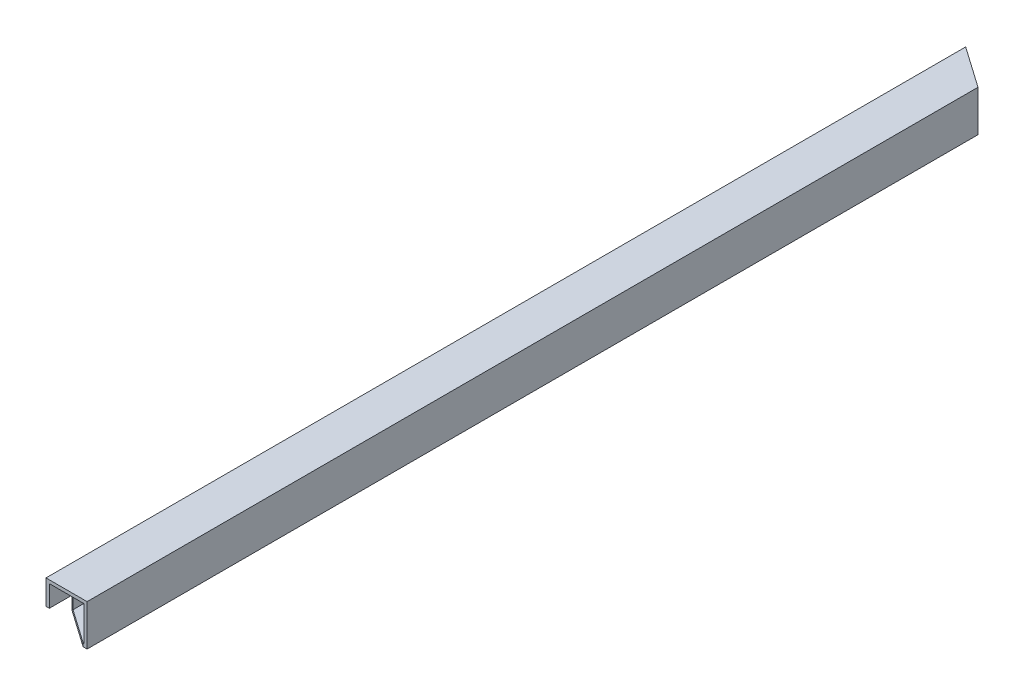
ISO-10303-21;
HEADER;
FILE_DESCRIPTION(('STEP AP214'),'2;1');
FILE_NAME('part.step','',(''),(''),'','','');
FILE_SCHEMA(('AUTOMOTIVE_DESIGN { 1 0 10303 214 1 1 1 1 }'));
ENDSEC;
DATA;
#1=APPLICATION_CONTEXT('core data for automotive mechanical design processes');
#2=APPLICATION_PROTOCOL_DEFINITION('international standard','automotive_design',2000,#1);
#3=PRODUCT_CONTEXT('',#1,'mechanical');
#4=PRODUCT('Part','Part','',(#3));
#5=PRODUCT_RELATED_PRODUCT_CATEGORY('part','',(#4));
#6=PRODUCT_DEFINITION_FORMATION('','',#4);
#7=PRODUCT_DEFINITION_CONTEXT('part definition',#1,'design');
#8=PRODUCT_DEFINITION('design','',#6,#7);
#9=PRODUCT_DEFINITION_SHAPE('','',#8);
#10=(LENGTH_UNIT() NAMED_UNIT(*) SI_UNIT(.MILLI.,.METRE.));
#11=(NAMED_UNIT(*) PLANE_ANGLE_UNIT() SI_UNIT($,.RADIAN.));
#12=(NAMED_UNIT(*) SI_UNIT($,.STERADIAN.) SOLID_ANGLE_UNIT());
#13=UNCERTAINTY_MEASURE_WITH_UNIT(LENGTH_MEASURE(1.E-05),#10,'distance_accuracy_value','');
#14=(GEOMETRIC_REPRESENTATION_CONTEXT(3) GLOBAL_UNCERTAINTY_ASSIGNED_CONTEXT((#13)) GLOBAL_UNIT_ASSIGNED_CONTEXT((#10,
#11,#12)) REPRESENTATION_CONTEXT('',''));
#15=CARTESIAN_POINT('',(0.,0.,0.));
#16=DIRECTION('',(0.,0.,1.));
#17=DIRECTION('',(1.,0.,0.));
#18=AXIS2_PLACEMENT_3D('',#15,#16,#17);
#19=CARTESIAN_POINT('',(-1363.134665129,19.766692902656,135.15200591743));
#20=DIRECTION('',(0.81912197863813,-0.0163824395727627,0.573385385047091));
#21=DIRECTION('',(-0.0199960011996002,-0.999800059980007,0.));
#22=AXIS2_PLACEMENT_3D('',#19,#20,#21);
#23=CYLINDRICAL_SURFACE('',#22,2.);
#24=CARTESIAN_POINT('',(-21.,-7.07600039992,1074.646271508));
#25=DIRECTION('',(1.,0.,0.));
#26=DIRECTION('',(0.,-0.0285597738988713,0.999592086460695));
#27=AXIS2_PLACEMENT_3D('',#24,#25,#26);
#28=ELLIPSE('',#27,2.441638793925,2.);
#29=CARTESIAN_POINT('',(-21.,-7.07600039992,1072.205120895));
#30=VERTEX_POINT('',#29);
#31=CARTESIAN_POINT('',(-21.,-5.075600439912,1074.618277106));
#32=VERTEX_POINT('',#31);
#33=EDGE_CURVE('E25',#30,#32,#28,.T.);
#34=ORIENTED_EDGE('',*,*,#33,.T.);
#35=DIRECTION('',(0.819121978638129,-0.0163824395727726,0.573385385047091));
#36=VECTOR('',#35,1.);
#37=CARTESIAN_POINT('',(-1363.094673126,21.766293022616,135.15200591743));
#38=LINE('',#37,#36);
#39=CARTESIAN_POINT('',(-25.,-4.995600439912,1071.818277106));
#40=VERTEX_POINT('',#39);
#41=EDGE_CURVE('E10',#40,#32,#38,.T.);
#42=ORIENTED_EDGE('',*,*,#41,.F.);
#43=CARTESIAN_POINT('',(-25.,-6.99600039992,1071.846271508));
#44=DIRECTION('',(1.,0.,0.));
#45=DIRECTION('',(0.,-0.0285597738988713,0.999592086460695));
#46=AXIS2_PLACEMENT_3D('',#43,#44,#45);
#47=ELLIPSE('',#46,2.441638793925,2.);
#48=CARTESIAN_POINT('',(-25.,-6.99600039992,1069.405120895));
#49=VERTEX_POINT('',#48);
#50=EDGE_CURVE('E193',#49,#40,#47,.T.);
#51=ORIENTED_EDGE('',*,*,#50,.F.);
#52=DIRECTION('',(0.819121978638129,-0.0163824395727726,0.573385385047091));
#53=VECTOR('',#52,1.);
#54=CARTESIAN_POINT('',(-1361.988123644,19.743762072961,133.51343434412));
#55=LINE('',#54,#53);
#56=EDGE_CURVE('E181',#49,#30,#55,.T.);
#57=ORIENTED_EDGE('',*,*,#56,.T.);
#58=EDGE_LOOP('',(#34,#42,#51,#57));
#59=FACE_BOUND('',#58,.T.);
#60=ADVANCED_FACE('F16',(#59),#23,.F.);
#61=CARTESIAN_POINT('',(-1363.094673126,21.766293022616,135.15200591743));
#62=DIRECTION('',(-0.0199960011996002,-0.999800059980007,0.));
#63=DIRECTION('',(-0.999800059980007,0.0199960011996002,0.));
#64=AXIS2_PLACEMENT_3D('',#61,#62,#63);
#65=PLANE('',#64);
#66=DIRECTION('',(0.,0.,-1.));
#67=VECTOR('',#66,1.);
#68=CARTESIAN_POINT('',(-25.,-4.995600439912,55.076002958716));
#69=LINE('',#68,#67);
#70=CARTESIAN_POINT('',(-25.,-4.995600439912,1101.26844483));
#71=VERTEX_POINT('',#70);
#72=EDGE_CURVE('E189',#71,#40,#69,.T.);
#73=ORIENTED_EDGE('',*,*,#72,.T.);
#74=ORIENTED_EDGE('',*,*,#41,.T.);
#75=DIRECTION('',(0.,0.,-1.));
#76=VECTOR('',#75,1.);
#77=CARTESIAN_POINT('',(-21.,-5.075600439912,55.076002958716));
#78=LINE('',#77,#76);
#79=CARTESIAN_POINT('',(-21.,-5.075600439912,1101.26844483));
#80=VERTEX_POINT('',#79);
#81=EDGE_CURVE('E144',#80,#32,#78,.T.);
#82=ORIENTED_EDGE('',*,*,#81,.F.);
#83=DIRECTION('',(-0.999800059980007,0.0199960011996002,0.));
#84=VECTOR('',#83,1.);
#85=CARTESIAN_POINT('',(-681.6022705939,8.136444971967,1101.26844483));
#86=LINE('',#85,#84);
#87=EDGE_CURVE('E159',#80,#71,#86,.T.);
#88=ORIENTED_EDGE('',*,*,#87,.T.);
#89=EDGE_LOOP('',(#73,#74,#82,#88));
#90=FACE_BOUND('',#89,.T.);
#91=ADVANCED_FACE('F18',(#90),#65,.T.);
#92=CARTESIAN_POINT('',(-21.,21.,-25.));
#93=DIRECTION('',(1.,0.,0.));
#94=DIRECTION('',(0.,1.,0.));
#95=AXIS2_PLACEMENT_3D('',#92,#93,#94);
#96=PLANE('',#95);
#97=DIRECTION('',(0.,-1.,0.));
#98=VECTOR('',#97,1.);
#99=CARTESIAN_POINT('',(-21.,10.5,-14.7));
#100=LINE('',#99,#98);
#101=CARTESIAN_POINT('',(-21.,21.,-14.7));
#102=VERTEX_POINT('',#101);
#103=CARTESIAN_POINT('',(-21.,-21.,-14.7));
#104=VERTEX_POINT('',#103);
#105=EDGE_CURVE('E139',#102,#104,#100,.T.);
#106=ORIENTED_EDGE('',*,*,#105,.F.);
#107=DIRECTION('',(0.,0.,1.));
#108=VECTOR('',#107,1.);
#109=CARTESIAN_POINT('',(-21.,21.,-25.));
#110=LINE('',#109,#108);
#111=CARTESIAN_POINT('',(-21.,21.,1101.26844483));
#112=VERTEX_POINT('',#111);
#113=EDGE_CURVE('E131',#102,#112,#110,.T.);
#114=ORIENTED_EDGE('',*,*,#113,.T.);
#115=DIRECTION('',(0.,1.,0.));
#116=VECTOR('',#115,1.);
#117=CARTESIAN_POINT('',(-21.,10.5,1101.26844483));
#118=LINE('',#117,#116);
#119=EDGE_CURVE('E136',#80,#112,#118,.T.);
#120=ORIENTED_EDGE('',*,*,#119,.F.);
#121=ORIENTED_EDGE('',*,*,#81,.T.);
#122=ORIENTED_EDGE('',*,*,#33,.F.);
#123=DIRECTION('',(0.,-0.999902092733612,0.0139930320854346));
#124=VECTOR('',#123,1.);
#125=CARTESIAN_POINT('',(-21.,14.617210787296,1071.901537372));
#126=LINE('',#125,#124);
#127=CARTESIAN_POINT('',(-21.,-21.,1072.399978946));
#128=VERTEX_POINT('',#127);
#129=EDGE_CURVE('E188',#30,#128,#126,.T.);
#130=ORIENTED_EDGE('',*,*,#129,.T.);
#131=DIRECTION('',(0.,0.,1.));
#132=VECTOR('',#131,1.);
#133=CARTESIAN_POINT('',(-21.,-21.,-25.));
#134=LINE('',#133,#132);
#135=EDGE_CURVE('E197',#104,#128,#134,.T.);
#136=ORIENTED_EDGE('',*,*,#135,.F.);
#137=EDGE_LOOP('',(#106,#114,#120,#121,#122,#130,#136));
#138=FACE_BOUND('',#137,.T.);
#139=ADVANCED_FACE('F133',(#138),#96,.T.);
#140=CARTESIAN_POINT('',(21.,21.,-25.));
#141=DIRECTION('',(0.,-1.,0.));
#142=DIRECTION('',(0.,0.,-1.));
#143=AXIS2_PLACEMENT_3D('',#140,#141,#142);
#144=PLANE('',#143);
#145=DIRECTION('',(-0.819231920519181,0.,-0.573462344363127));
#146=VECTOR('',#145,1.);
#147=CARTESIAN_POINT('',(1.174496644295,21.,0.822147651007));
#148=LINE('',#147,#146);
#149=CARTESIAN_POINT('',(21.,21.,14.7));
#150=VERTEX_POINT('',#149);
#151=EDGE_CURVE('E249',#150,#102,#148,.T.);
#152=ORIENTED_EDGE('',*,*,#151,.F.);
#153=DIRECTION('',(0.,0.,1.));
#154=VECTOR('',#153,1.);
#155=CARTESIAN_POINT('',(21.,21.,-25.));
#156=LINE('',#155,#154);
#157=CARTESIAN_POINT('',(21.,21.,1101.26844483));
#158=VERTEX_POINT('',#157);
#159=EDGE_CURVE('E145',#150,#158,#156,.T.);
#160=ORIENTED_EDGE('',*,*,#159,.T.);
#161=DIRECTION('',(1.,0.,0.));
#162=VECTOR('',#161,1.);
#163=CARTESIAN_POINT('',(10.5,21.,1101.26844483));
#164=LINE('',#163,#162);
#165=EDGE_CURVE('E148',#112,#158,#164,.T.);
#166=ORIENTED_EDGE('',*,*,#165,.F.);
#167=ORIENTED_EDGE('',*,*,#113,.F.);
#168=EDGE_LOOP('',(#152,#160,#166,#167));
#169=FACE_BOUND('',#168,.T.);
#170=ADVANCED_FACE('F149',(#169),#144,.T.);
#171=CARTESIAN_POINT('',(21.,-21.,-25.));
#172=DIRECTION('',(-1.,0.,0.));
#173=DIRECTION('',(0.,0.,1.));
#174=AXIS2_PLACEMENT_3D('',#171,#172,#173);
#175=PLANE('',#174);
#176=DIRECTION('',(0.,1.,0.));
#177=VECTOR('',#176,1.);
#178=CARTESIAN_POINT('',(21.,-10.5,14.7));
#179=LINE('',#178,#177);
#180=CARTESIAN_POINT('',(21.,-21.,14.7));
#181=VERTEX_POINT('',#180);
#182=EDGE_CURVE('E234',#181,#150,#179,.T.);
#183=ORIENTED_EDGE('',*,*,#182,.F.);
#184=DIRECTION('',(0.,0.,1.));
#185=VECTOR('',#184,1.);
#186=CARTESIAN_POINT('',(21.,-21.,-25.));
#187=LINE('',#186,#185);
#188=CARTESIAN_POINT('',(21.,-21.,1101.26844483));
#189=VERTEX_POINT('',#188);
#190=EDGE_CURVE('E194',#181,#189,#187,.T.);
#191=ORIENTED_EDGE('',*,*,#190,.T.);
#192=DIRECTION('',(0.,-1.,0.));
#193=VECTOR('',#192,1.);
#194=CARTESIAN_POINT('',(21.,-10.5,1101.26844483));
#195=LINE('',#194,#193);
#196=EDGE_CURVE('E154',#158,#189,#195,.T.);
#197=ORIENTED_EDGE('',*,*,#196,.F.);
#198=ORIENTED_EDGE('',*,*,#159,.F.);
#199=EDGE_LOOP('',(#183,#191,#197,#198));
#200=FACE_BOUND('',#199,.T.);
#201=ADVANCED_FACE('F305',(#200),#175,.T.);
#202=CARTESIAN_POINT('',(-21.,-21.,-25.));
#203=DIRECTION('',(0.,1.,0.));
#204=DIRECTION('',(1.,0.,0.));
#205=AXIS2_PLACEMENT_3D('',#202,#203,#204);
#206=PLANE('',#205);
#207=DIRECTION('',(0.819231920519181,0.,0.573462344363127));
#208=VECTOR('',#207,1.);
#209=CARTESIAN_POINT('',(-12.91946308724,-21.,-9.043624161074));
#210=LINE('',#209,#208);
#211=EDGE_CURVE('E270',#104,#181,#210,.T.);
#212=ORIENTED_EDGE('',*,*,#211,.F.);
#213=ORIENTED_EDGE('',*,*,#135,.T.);
#214=DIRECTION('',(0.819339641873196,0.,0.573308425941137));
#215=VECTOR('',#214,1.);
#216=CARTESIAN_POINT('',(-949.6396694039,-21.,422.61212550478));
#217=LINE('',#216,#215);
#218=CARTESIAN_POINT('',(20.257161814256,-21.,1101.26844483));
#219=VERTEX_POINT('',#218);
#220=EDGE_CURVE('E185',#128,#219,#217,.T.);
#221=ORIENTED_EDGE('',*,*,#220,.T.);
#222=DIRECTION('',(-1.,0.,0.));
#223=VECTOR('',#222,1.);
#224=CARTESIAN_POINT('',(-10.5,-21.,1101.26844483));
#225=LINE('',#224,#223);
#226=EDGE_CURVE('E170',#189,#219,#225,.T.);
#227=ORIENTED_EDGE('',*,*,#226,.F.);
#228=ORIENTED_EDGE('',*,*,#190,.F.);
#229=EDGE_LOOP('',(#212,#213,#221,#227,#228));
#230=FACE_BOUND('',#229,.T.);
#231=ADVANCED_FACE('F300',(#230),#206,.T.);
#232=CARTESIAN_POINT('',(25.,25.,-25.));
#233=DIRECTION('',(0.,-1.,0.));
#234=DIRECTION('',(0.,0.,-1.));
#235=AXIS2_PLACEMENT_3D('',#232,#233,#234);
#236=PLANE('',#235);
#237=DIRECTION('',(0.,0.,1.));
#238=VECTOR('',#237,1.);
#239=CARTESIAN_POINT('',(-25.,25.,-25.));
#240=LINE('',#239,#238);
#241=CARTESIAN_POINT('',(-25.,25.,-17.5));
#242=VERTEX_POINT('',#241);
#243=CARTESIAN_POINT('',(-25.,25.,1101.26844483));
#244=VERTEX_POINT('',#243);
#245=EDGE_CURVE('E192',#242,#244,#240,.T.);
#246=ORIENTED_EDGE('',*,*,#245,.T.);
#247=DIRECTION('',(1.,0.,0.));
#248=VECTOR('',#247,1.);
#249=CARTESIAN_POINT('',(12.5,25.,1101.26844483));
#250=LINE('',#249,#248);
#251=CARTESIAN_POINT('',(25.,25.,1101.26844483));
#252=VERTEX_POINT('',#251);
#253=EDGE_CURVE('E178',#244,#252,#250,.T.);
#254=ORIENTED_EDGE('',*,*,#253,.T.);
#255=DIRECTION('',(0.,0.,1.));
#256=VECTOR('',#255,1.);
#257=CARTESIAN_POINT('',(25.,25.,-25.));
#258=LINE('',#257,#256);
#259=CARTESIAN_POINT('',(25.,25.,17.5));
#260=VERTEX_POINT('',#259);
#261=EDGE_CURVE('E219',#260,#252,#258,.T.);
#262=ORIENTED_EDGE('',*,*,#261,.F.);
#263=DIRECTION('',(-0.819231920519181,0.,-0.573462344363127));
#264=VECTOR('',#263,1.);
#265=CARTESIAN_POINT('',(2.51677852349,25.,1.761744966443));
#266=LINE('',#265,#264);
#267=EDGE_CURVE('E260',#260,#242,#266,.T.);
#268=ORIENTED_EDGE('',*,*,#267,.T.);
#269=EDGE_LOOP('',(#246,#254,#262,#268));
#270=FACE_BOUND('',#269,.T.);
#271=ADVANCED_FACE('F286',(#270),#236,.F.);
#272=CARTESIAN_POINT('',(-25.,25.,-25.));
#273=DIRECTION('',(1.,0.,0.));
#274=DIRECTION('',(0.,1.,0.));
#275=AXIS2_PLACEMENT_3D('',#272,#273,#274);
#276=PLANE('',#275);
#277=DIRECTION('',(0.,0.,1.));
#278=VECTOR('',#277,1.);
#279=CARTESIAN_POINT('',(-25.,-25.,-25.));
#280=LINE('',#279,#278);
#281=CARTESIAN_POINT('',(-25.,-25.,-17.5));
#282=VERTEX_POINT('',#281);
#283=CARTESIAN_POINT('',(-25.,-25.,1069.657076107));
#284=VERTEX_POINT('',#283);
#285=EDGE_CURVE('E240',#282,#284,#280,.T.);
#286=ORIENTED_EDGE('',*,*,#285,.T.);
#287=DIRECTION('',(0.,-0.999902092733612,0.0139930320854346));
#288=VECTOR('',#287,1.);
#289=CARTESIAN_POINT('',(-25.,16.577658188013,1069.075221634));
#290=LINE('',#289,#288);
#291=EDGE_CURVE('E182',#49,#284,#290,.T.);
#292=ORIENTED_EDGE('',*,*,#291,.F.);
#293=ORIENTED_EDGE('',*,*,#50,.T.);
#294=ORIENTED_EDGE('',*,*,#72,.F.);
#295=DIRECTION('',(0.,1.,0.));
#296=VECTOR('',#295,1.);
#297=CARTESIAN_POINT('',(-25.,12.5,1101.26844483));
#298=LINE('',#297,#296);
#299=EDGE_CURVE('E164',#71,#244,#298,.T.);
#300=ORIENTED_EDGE('',*,*,#299,.T.);
#301=ORIENTED_EDGE('',*,*,#245,.F.);
#302=DIRECTION('',(0.,-1.,0.));
#303=VECTOR('',#302,1.);
#304=CARTESIAN_POINT('',(-25.,12.5,-17.5));
#305=LINE('',#304,#303);
#306=EDGE_CURVE('E232',#242,#282,#305,.T.);
#307=ORIENTED_EDGE('',*,*,#306,.T.);
#308=EDGE_LOOP('',(#286,#292,#293,#294,#300,#301,#307));
#309=FACE_BOUND('',#308,.T.);
#310=ADVANCED_FACE('F295',(#309),#276,.F.);
#311=CARTESIAN_POINT('',(-1362.787963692,-20.24824032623,133.51343434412));
#312=DIRECTION('',(-0.573270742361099,0.011465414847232,0.819285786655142));
#313=DIRECTION('',(0.0199960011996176,0.999800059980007,0.));
#314=AXIS2_PLACEMENT_3D('',#311,#312,#313);
#315=PLANE('',#314);
#316=ORIENTED_EDGE('',*,*,#56,.F.);
#317=ORIENTED_EDGE('',*,*,#291,.T.);
#318=DIRECTION('',(0.819339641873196,0.,0.573308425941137));
#319=VECTOR('',#318,1.);
#320=CARTESIAN_POINT('',(-951.0085989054,-25.,421.71023560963));
#321=LINE('',#320,#319);
#322=CARTESIAN_POINT('',(20.177161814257,-25.,1101.26844483));
#323=VERTEX_POINT('',#322);
#324=EDGE_CURVE('E236',#284,#323,#321,.T.);
#325=ORIENTED_EDGE('',*,*,#324,.T.);
#326=DIRECTION('',(0.0199960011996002,0.999800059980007,0.));
#327=VECTOR('',#326,1.);
#328=CARTESIAN_POINT('',(20.194044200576,-24.15588068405,1101.26844483));
#329=LINE('',#328,#327);
#330=EDGE_CURVE('E174',#323,#219,#329,.T.);
#331=ORIENTED_EDGE('',*,*,#330,.T.);
#332=ORIENTED_EDGE('',*,*,#220,.F.);
#333=ORIENTED_EDGE('',*,*,#129,.F.);
#334=EDGE_LOOP('',(#316,#317,#325,#331,#332,#333));
#335=FACE_BOUND('',#334,.T.);
#336=ADVANCED_FACE('F298',(#335),#315,.T.);
#337=CARTESIAN_POINT('',(0.,0.,1101.26844483));
#338=DIRECTION('',(0.,0.,-1.));
#339=DIRECTION('',(0.,-1.,0.));
#340=AXIS2_PLACEMENT_3D('',#337,#338,#339);
#341=PLANE('',#340);
#342=ORIENTED_EDGE('',*,*,#299,.F.);
#343=ORIENTED_EDGE('',*,*,#87,.F.);
#344=ORIENTED_EDGE('',*,*,#119,.T.);
#345=ORIENTED_EDGE('',*,*,#165,.T.);
#346=ORIENTED_EDGE('',*,*,#196,.T.);
#347=ORIENTED_EDGE('',*,*,#226,.T.);
#348=ORIENTED_EDGE('',*,*,#330,.F.);
#349=DIRECTION('',(-1.,0.,0.));
#350=VECTOR('',#349,1.);
#351=CARTESIAN_POINT('',(-12.5,-25.,1101.26844483));
#352=LINE('',#351,#350);
#353=CARTESIAN_POINT('',(25.,-25.,1101.26844483));
#354=VERTEX_POINT('',#353);
#355=EDGE_CURVE('E241',#354,#323,#352,.T.);
#356=ORIENTED_EDGE('',*,*,#355,.F.);
#357=DIRECTION('',(0.,-1.,0.));
#358=VECTOR('',#357,1.);
#359=CARTESIAN_POINT('',(25.,-12.5,1101.26844483));
#360=LINE('',#359,#358);
#361=EDGE_CURVE('E213',#252,#354,#360,.T.);
#362=ORIENTED_EDGE('',*,*,#361,.F.);
#363=ORIENTED_EDGE('',*,*,#253,.F.);
#364=EDGE_LOOP('',(#342,#343,#344,#345,#346,#347,#348,#356,#362,#363));
#365=FACE_BOUND('',#364,.T.);
#366=ADVANCED_FACE('F157',(#365),#341,.F.);
#367=CARTESIAN_POINT('',(25.,-25.,-25.));
#368=DIRECTION('',(-1.,0.,0.));
#369=DIRECTION('',(0.,0.,1.));
#370=AXIS2_PLACEMENT_3D('',#367,#368,#369);
#371=PLANE('',#370);
#372=ORIENTED_EDGE('',*,*,#261,.T.);
#373=ORIENTED_EDGE('',*,*,#361,.T.);
#374=DIRECTION('',(0.,0.,1.));
#375=VECTOR('',#374,1.);
#376=CARTESIAN_POINT('',(25.,-25.,-25.));
#377=LINE('',#376,#375);
#378=CARTESIAN_POINT('',(25.,-25.,17.5));
#379=VERTEX_POINT('',#378);
#380=EDGE_CURVE('E242',#379,#354,#377,.T.);
#381=ORIENTED_EDGE('',*,*,#380,.F.);
#382=DIRECTION('',(0.,1.,0.));
#383=VECTOR('',#382,1.);
#384=CARTESIAN_POINT('',(25.,-12.5,17.5));
#385=LINE('',#384,#383);
#386=EDGE_CURVE('E235',#379,#260,#385,.T.);
#387=ORIENTED_EDGE('',*,*,#386,.T.);
#388=EDGE_LOOP('',(#372,#373,#381,#387));
#389=FACE_BOUND('',#388,.T.);
#390=ADVANCED_FACE('F282',(#389),#371,.F.);
#391=CARTESIAN_POINT('',(0.,0.,0.));
#392=DIRECTION('',(-0.573462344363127,0.,0.819231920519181));
#393=DIRECTION('',(0.,1.,0.));
#394=AXIS2_PLACEMENT_3D('',#391,#392,#393);
#395=PLANE('',#394);
#396=ORIENTED_EDGE('',*,*,#182,.T.);
#397=ORIENTED_EDGE('',*,*,#151,.T.);
#398=ORIENTED_EDGE('',*,*,#105,.T.);
#399=ORIENTED_EDGE('',*,*,#211,.T.);
#400=EDGE_LOOP('',(#396,#397,#398,#399));
#401=FACE_BOUND('',#400,.T.);
#402=ORIENTED_EDGE('',*,*,#267,.F.);
#403=ORIENTED_EDGE('',*,*,#386,.F.);
#404=DIRECTION('',(0.819231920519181,0.,0.573462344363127));
#405=VECTOR('',#404,1.);
#406=CARTESIAN_POINT('',(-14.26174496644,-25.,-9.98322147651));
#407=LINE('',#406,#405);
#408=EDGE_CURVE('E256',#282,#379,#407,.T.);
#409=ORIENTED_EDGE('',*,*,#408,.F.);
#410=ORIENTED_EDGE('',*,*,#306,.F.);
#411=EDGE_LOOP('',(#402,#403,#409,#410));
#412=FACE_BOUND('',#411,.T.);
#413=ADVANCED_FACE('F294',(#401,#412),#395,.F.);
#414=CARTESIAN_POINT('',(-25.,-25.,-25.));
#415=DIRECTION('',(0.,1.,0.));
#416=DIRECTION('',(1.,0.,0.));
#417=AXIS2_PLACEMENT_3D('',#414,#415,#416);
#418=PLANE('',#417);
#419=ORIENTED_EDGE('',*,*,#380,.T.);
#420=ORIENTED_EDGE('',*,*,#355,.T.);
#421=ORIENTED_EDGE('',*,*,#324,.F.);
#422=ORIENTED_EDGE('',*,*,#285,.F.);
#423=ORIENTED_EDGE('',*,*,#408,.T.);
#424=EDGE_LOOP('',(#419,#420,#421,#422,#423));
#425=FACE_BOUND('',#424,.T.);
#426=ADVANCED_FACE('F289',(#425),#418,.F.);
#427=CLOSED_SHELL('',(#60,#91,#139,#170,#201,#231,#271,#310,#336,#366,#390,#413,#426));
#428=MANIFOLD_SOLID_BREP('B1',#427);
#429=ADVANCED_BREP_SHAPE_REPRESENTATION('',(#18,#428),#14);
#430=SHAPE_DEFINITION_REPRESENTATION(#9,#429);
ENDSEC;
END-ISO-10303-21;
